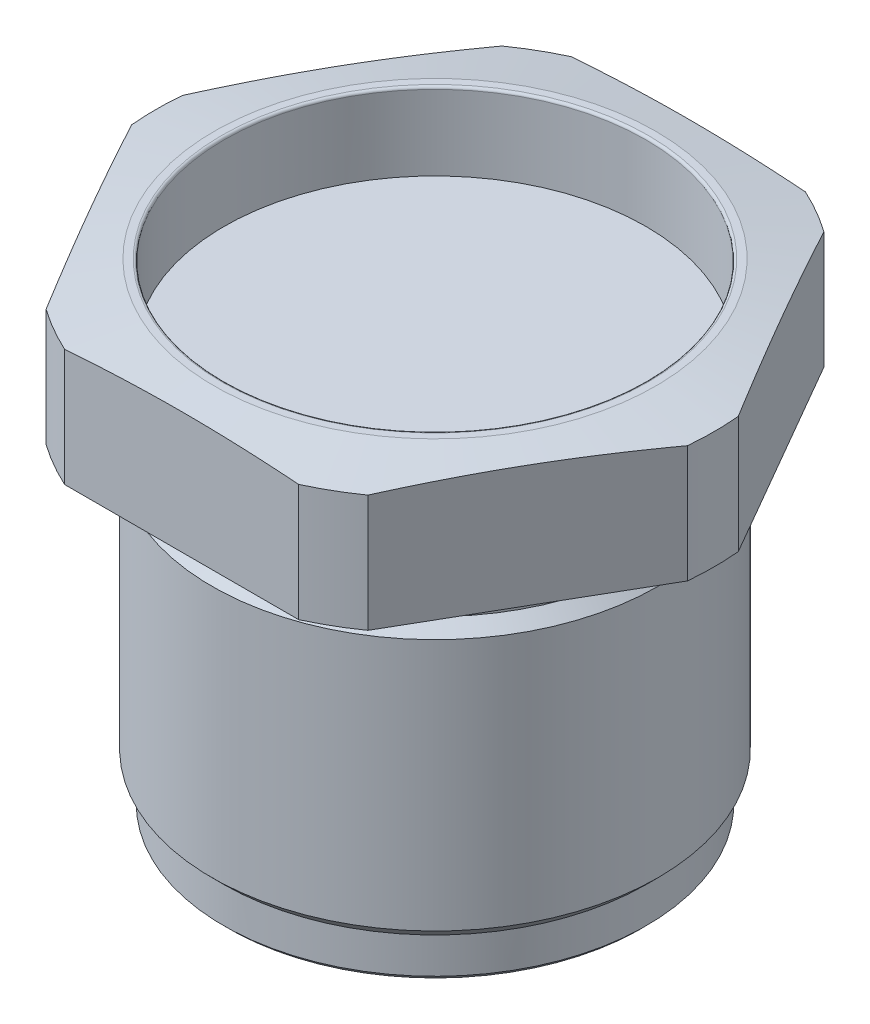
from build123d import *

# Parameters (mm, degrees)
FILLET7_R          = 0.25
SKETCH7_OUTSIDE_W  = 76.01
SKETCH7_OUTSIDE_H  = 76.01
CUT_EXTRUDE5_DEPTH = 53.55059276
CHAMFER2_SIZE      = 0.49999776
FILLET8_R          = 1.016
SKETCH9_W          = 7.5819
SKETCH9_H          = 1.3716


with BuildPart() as part:
    # Sketch6 → Revolve3 (revolve)
    with BuildSketch(Plane.XY, mode=Mode.PRIVATE) as revolve3_sk:
        Polygon((21.0185, 12.7), (21.9964, 12.7), (27.813, 11.674376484), (27.813, 0), (21.0566, 0), (21.0566, -34.8488), (0, -34.8488), (0, 4.9784), (21.0185, 4.9784), align=None)
    revolve(revolve3_sk.sketch.rotate(Axis((0, -8.968942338, 0), (0, 1, 0)), 90), axis=Axis((0, -8.968942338, 0), (0, 1, 0)))

    # Fillet7
    fillet7_edges = [part.edges().sort_by_distance(p)[0] for p in [
        (0, 12.7, 21.0185),
    ]]
    fillet(fillet7_edges, radius=FILLET7_R)

    # Sketch7 outside → Cut-Extrude5 (cut, through all)
    with BuildSketch(Plane.XZ):
        Rectangle(SKETCH7_OUTSIDE_W, SKETCH7_OUTSIDE_H)
        Polygon((-14.578101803, 25.250013), (14.578101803, 25.250013), (29.156203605, 0), (14.578101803, -25.250013), (-14.578101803, -25.250013), (-29.156203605, 0), align=None, mode=Mode.SUBTRACT)
    extrude(amount=-CUT_EXTRUDE5_DEPTH, mode=Mode.SUBTRACT)

    # Chamfer2
    chamfer2_edges = [part.edges().sort_by_distance(p)[0] for p in [
        (0, -34.8488, 21.0566),
    ]]
    chamfer(chamfer2_edges, length=CHAMFER2_SIZE)

    # Sketch8 → Revolve4 (revolve)
    with BuildSketch(Plane.XY, mode=Mode.PRIVATE) as revolve4_sk:
        Polygon((-21.0566, -3.302), (-21.0566, -30.7848), (-22.225, -29.6164), (-22.225, -4.4704), align=None)
    revolve(revolve4_sk.sketch.rotate(Axis((0, 0, 0), (0, -1, 0)), 90), axis=Axis((0, 0, 0), (0, -1, 0)))

    # Fillet8
    fillet8_edges = [part.edges().sort_by_distance(p)[0] for p in [
        (0, 0, 21.0566),
    ]]
    fillet(fillet8_edges, radius=FILLET8_R)

    # Sketch9 → Cut-Revolve1 (revolve, cut)
    with BuildSketch(Plane.XY, mode=Mode.PRIVATE) as cut_revolve1_sk:
        with Locations((3.79095, -34.163)):
            Rectangle(SKETCH9_W, SKETCH9_H)
        with BuildLine():
            Line((9.3853, -34.8488), (9.3853, -34.3154))
            ThreePointArc((9.3853, -34.3154), (9.430920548, -34.596526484), (9.5631, -34.8488))
            Line((9.5631, -34.8488), (9.3853, -34.8488))
        make_face()
        with BuildLine():
            Line((11.1633, -34.3154), (11.1633, -34.8488))
            Line((11.1633, -34.8488), (10.9855, -34.8488))
            ThreePointArc((10.9855, -34.8488), (11.117679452, -34.596526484), (11.1633, -34.3154))
        make_face()
        with BuildLine():
            Line((13.5636, -33.4772), (18.1864, -33.4772))
            ThreePointArc((18.1864, -33.4772), (17.405582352, -33.941176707), (17.439795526, -34.8488))
            Line((17.439795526, -34.8488), (12.192, -34.8488))
            ThreePointArc((12.192, -34.8488), (12.593732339, -33.878932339), (13.5636, -33.4772))
        make_face()
    revolve(cut_revolve1_sk.sketch.rotate(Axis((0, 0, 0), (0, -1, 0)), 180), axis=Axis((0, 0, 0), (0, -1, 0)), mode=Mode.SUBTRACT)

    # Sketch10 → Revolve6 (revolve)
    with BuildSketch(Plane.XY, mode=Mode.PRIVATE) as revolve6_sk:
        with BuildLine():
            Line((-18.933004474, -34.798), (-17.439795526, -34.798))
            ThreePointArc((-17.439795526, -34.798), (-18.1864, -35.2044), (-18.933004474, -34.798))
        make_face()
        with BuildLine():
            Line((-11.020904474, -34.798), (-9.527695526, -34.798))
            ThreePointArc((-9.527695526, -34.798), (-10.2743, -35.2044), (-11.020904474, -34.798))
        make_face()
    revolve(revolve6_sk.sketch.rotate(Axis((0, 0, 0), (0, -1, 0)), 270), axis=Axis((0, 0, 0), (0, -1, 0)))


solid = part.part
